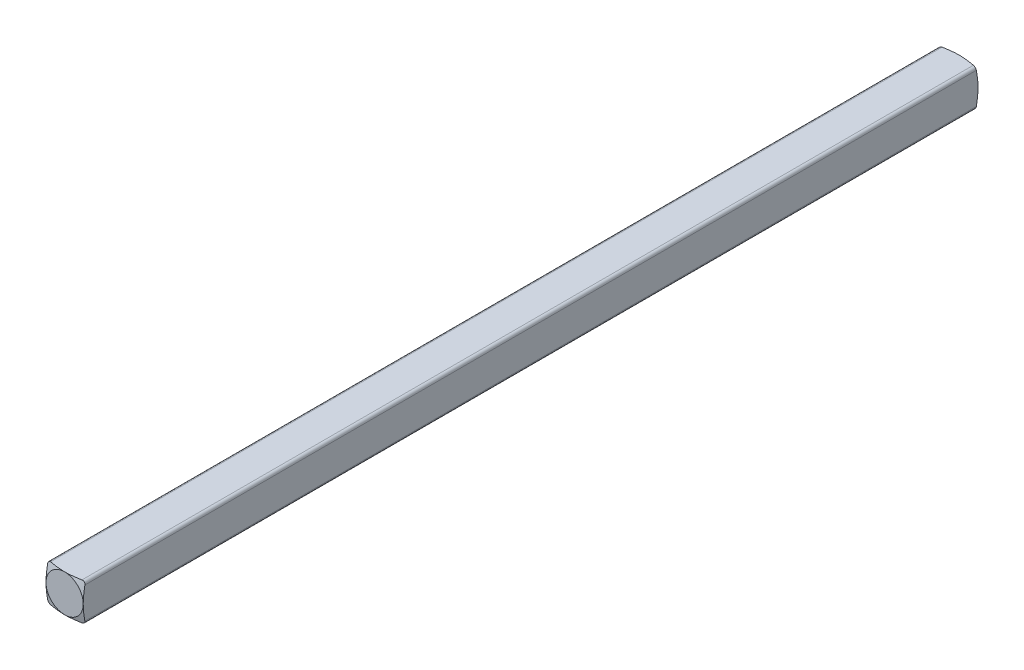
ISO-10303-21;
HEADER;
FILE_DESCRIPTION(('STEP AP214'),'2;1');
FILE_NAME('part.step','',(''),(''),'','','');
FILE_SCHEMA(('AUTOMOTIVE_DESIGN { 1 0 10303 214 1 1 1 1 }'));
ENDSEC;
DATA;
#1=APPLICATION_CONTEXT('core data for automotive mechanical design processes');
#2=APPLICATION_PROTOCOL_DEFINITION('international standard','automotive_design',2000,#1);
#3=PRODUCT_CONTEXT('',#1,'mechanical');
#4=PRODUCT('Part','Part','',(#3));
#5=PRODUCT_RELATED_PRODUCT_CATEGORY('part','',(#4));
#6=PRODUCT_DEFINITION_FORMATION('','',#4);
#7=PRODUCT_DEFINITION_CONTEXT('part definition',#1,'design');
#8=PRODUCT_DEFINITION('design','',#6,#7);
#9=PRODUCT_DEFINITION_SHAPE('','',#8);
#10=(LENGTH_UNIT() NAMED_UNIT(*) SI_UNIT(.MILLI.,.METRE.));
#11=(NAMED_UNIT(*) PLANE_ANGLE_UNIT() SI_UNIT($,.RADIAN.));
#12=(NAMED_UNIT(*) SI_UNIT($,.STERADIAN.) SOLID_ANGLE_UNIT());
#13=UNCERTAINTY_MEASURE_WITH_UNIT(LENGTH_MEASURE(1.E-05),#10,'distance_accuracy_value','');
#14=(GEOMETRIC_REPRESENTATION_CONTEXT(3) GLOBAL_UNCERTAINTY_ASSIGNED_CONTEXT((#13)) GLOBAL_UNIT_ASSIGNED_CONTEXT((#10,
#11,#12)) REPRESENTATION_CONTEXT('',''));
#15=CARTESIAN_POINT('',(0.,0.,0.));
#16=DIRECTION('',(0.,0.,1.));
#17=DIRECTION('',(1.,0.,0.));
#18=AXIS2_PLACEMENT_3D('',#15,#16,#17);
#19=CARTESIAN_POINT('',(-1.53487723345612,-1.585,38.1));
#20=DIRECTION('',(1.,0.,0.));
#21=DIRECTION('',(0.,1.,0.));
#22=AXIS2_PLACEMENT_3D('',#19,#20,#21);
#23=PLANE('',#22);
#24=CARTESIAN_POINT('',(-1.53487723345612,-3.16666521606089,-37.5259021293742));
#25=CARTESIAN_POINT('',(-1.53487723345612,-3.08469064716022,-37.5474134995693));
#26=CARTESIAN_POINT('',(-1.53487723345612,-3.00267602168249,-37.5687725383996));
#27=CARTESIAN_POINT('',(-1.53487723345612,-2.83854664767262,-37.6111088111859));
#28=CARTESIAN_POINT('',(-1.53487723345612,-2.75643189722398,-37.6320860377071));
#29=CARTESIAN_POINT('',(-1.53487723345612,-2.50995900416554,-37.6943162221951));
#30=CARTESIAN_POINT('',(-1.53487723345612,-2.3454255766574,-37.73488001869));
#31=CARTESIAN_POINT('',(-1.53487723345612,-2.01672815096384,-37.8129127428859));
#32=CARTESIAN_POINT('',(-1.53487723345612,-1.85256851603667,-37.850399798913));
#33=CARTESIAN_POINT('',(-1.53487723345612,-1.52315459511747,-37.9208840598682));
#34=CARTESIAN_POINT('',(-1.53487723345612,-1.3578996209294,-37.9538780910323));
#35=CARTESIAN_POINT('',(-1.53487723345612,-1.02346692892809,-38.0128592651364));
#36=CARTESIAN_POINT('',(-1.53487723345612,-0.854267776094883,-38.0387322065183));
#37=CARTESIAN_POINT('',(-1.53487723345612,-0.599515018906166,-38.068359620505));
#38=CARTESIAN_POINT('',(-1.53487723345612,-0.514501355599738,-38.0767023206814));
#39=CARTESIAN_POINT('',(-1.53487723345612,-0.344193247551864,-38.0897696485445));
#40=CARTESIAN_POINT('',(-1.53487723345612,-0.25889881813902,-38.0944944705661));
#41=CARTESIAN_POINT('',(-1.53487723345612,-0.0877661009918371,-38.0999590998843));
#42=CARTESIAN_POINT('',(-1.53487723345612,-0.00192717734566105,-38.1006795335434));
#43=CARTESIAN_POINT('',(-1.53487723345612,0.169686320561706,-38.09801863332));
#44=CARTESIAN_POINT('',(-1.53487723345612,0.255460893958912,-38.0946372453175));
#45=CARTESIAN_POINT('',(-1.53487723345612,0.426896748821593,-38.0840536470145));
#46=CARTESIAN_POINT('',(-1.53487723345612,0.512557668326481,-38.0768457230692));
#47=CARTESIAN_POINT('',(-1.53487723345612,0.683531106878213,-38.0591333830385));
#48=CARTESIAN_POINT('',(-1.53487723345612,0.76884362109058,-38.0486289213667));
#49=CARTESIAN_POINT('',(-1.53487723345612,0.974055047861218,-38.0200668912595));
#50=CARTESIAN_POINT('',(-1.53487723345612,1.09376665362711,-38.0006791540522));
#51=CARTESIAN_POINT('',(-1.53487723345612,1.33251777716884,-37.9580930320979));
#52=CARTESIAN_POINT('',(-1.53487723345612,1.45155714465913,-37.9348938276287));
#53=CARTESIAN_POINT('',(-1.53487723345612,1.68916216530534,-37.8858147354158));
#54=CARTESIAN_POINT('',(-1.53487723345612,1.80772743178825,-37.859932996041));
#55=CARTESIAN_POINT('',(-1.53487723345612,2.04441891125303,-37.8062944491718));
#56=CARTESIAN_POINT('',(-1.53487723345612,2.16254515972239,-37.7785377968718));
#57=CARTESIAN_POINT('',(-1.53487723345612,2.39875520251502,-37.721613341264));
#58=CARTESIAN_POINT('',(-1.53487723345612,2.51683821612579,-37.6924423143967));
#59=CARTESIAN_POINT('',(-1.53487723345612,2.75275603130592,-37.6331112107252));
#60=CARTESIAN_POINT('',(-1.53487723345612,2.87059082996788,-37.6029511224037));
#61=CARTESIAN_POINT('',(-1.53487723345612,3.22371274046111,-37.5114063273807));
#62=CARTESIAN_POINT('',(-1.53487723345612,3.45871696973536,-37.4489325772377));
#63=CARTESIAN_POINT('',(-1.53487723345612,3.92636425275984,-37.3228008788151));
#64=CARTESIAN_POINT('',(-1.53487723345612,4.15901102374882,-37.2591566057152));
#65=CARTESIAN_POINT('',(-1.53487723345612,4.62403801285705,-37.1307856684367));
#66=CARTESIAN_POINT('',(-1.53487723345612,4.85641819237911,-37.0660588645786));
#67=CARTESIAN_POINT('',(-1.53487723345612,5.31976447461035,-36.9362295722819));
#68=CARTESIAN_POINT('',(-1.53487723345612,5.55073162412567,-36.8711308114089));
#69=CARTESIAN_POINT('',(-1.53487723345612,6.01248807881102,-36.7404294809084));
#70=CARTESIAN_POINT('',(-1.53487723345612,6.24327740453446,-36.6748269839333));
#71=CARTESIAN_POINT('',(-1.53487723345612,6.47402102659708,-36.6090655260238));
#72=B_SPLINE_CURVE_WITH_KNOTS('',3,(#24,#25,#26,#27,#28,#29,#30,#31,#32,#33,#34,#35,#36,#37,#38,
#39,#40,#41,#42,#43,#44,#45,#46,#47,#48,#49,#50,#51,#52,#53,#54,#55,#56,#57,#58,#59,#60,#61,#62,
#63,#64,#65,#66,#67,#68,#69,#70,#71),.UNSPECIFIED.,.F.,.F.,(4,2,2,2,2,2,2,2,2,2,2,2,2,2,2,2,2,2,
2,2,2,2,2,4),(0.,0.254249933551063,0.508504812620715,1.01686983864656,1.52198475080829,
2.02745463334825,2.54061232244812,2.79681427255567,3.05300245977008,3.31042903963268,
3.56785901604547,3.82567446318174,4.08349347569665,4.4472125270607,4.81100990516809,
5.17506008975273,5.53908017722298,5.90397296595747,6.26887000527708,6.99835638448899,
7.72193914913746,8.44561600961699,9.1655133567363,9.88530875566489),.UNSPECIFIED.);
#73=CARTESIAN_POINT('',(-1.53487723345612,0.,-38.1));
#74=VERTEX_POINT('',#73);
#75=CARTESIAN_POINT('',(-1.53487723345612,-1.335,-37.95698643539));
#76=VERTEX_POINT('',#75);
#77=EDGE_CURVE('E126',#74,#76,#72,.F.);
#78=ORIENTED_EDGE('',*,*,#77,.T.);
#79=DIRECTION('',(0.,0.,-1.));
#80=VECTOR('',#79,1.);
#81=CARTESIAN_POINT('',(-1.53487723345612,-1.335,38.1));
#82=LINE('',#81,#80);
#83=CARTESIAN_POINT('',(-1.53487723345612,-1.335,37.95698643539));
#84=VERTEX_POINT('',#83);
#85=EDGE_CURVE('E56',#76,#84,#82,.F.);
#86=ORIENTED_EDGE('',*,*,#85,.T.);
#87=CARTESIAN_POINT('',(-1.53487723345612,-3.16666521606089,37.5259021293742));
#88=CARTESIAN_POINT('',(-1.53487723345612,-3.08469064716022,37.5474134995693));
#89=CARTESIAN_POINT('',(-1.53487723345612,-3.00267602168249,37.5687725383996));
#90=CARTESIAN_POINT('',(-1.53487723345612,-2.83854664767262,37.6111088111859));
#91=CARTESIAN_POINT('',(-1.53487723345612,-2.75643189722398,37.6320860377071));
#92=CARTESIAN_POINT('',(-1.53487723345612,-2.50995900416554,37.6943162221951));
#93=CARTESIAN_POINT('',(-1.53487723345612,-2.3454255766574,37.73488001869));
#94=CARTESIAN_POINT('',(-1.53487723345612,-2.01672815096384,37.8129127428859));
#95=CARTESIAN_POINT('',(-1.53487723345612,-1.85256851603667,37.850399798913));
#96=CARTESIAN_POINT('',(-1.53487723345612,-1.52315459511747,37.9208840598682));
#97=CARTESIAN_POINT('',(-1.53487723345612,-1.3578996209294,37.9538780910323));
#98=CARTESIAN_POINT('',(-1.53487723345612,-1.02346692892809,38.0128592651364));
#99=CARTESIAN_POINT('',(-1.53487723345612,-0.854267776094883,38.0387322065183));
#100=CARTESIAN_POINT('',(-1.53487723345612,-0.599515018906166,38.068359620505));
#101=CARTESIAN_POINT('',(-1.53487723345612,-0.514501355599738,38.0767023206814));
#102=CARTESIAN_POINT('',(-1.53487723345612,-0.344193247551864,38.0897696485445));
#103=CARTESIAN_POINT('',(-1.53487723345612,-0.25889881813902,38.0944944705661));
#104=CARTESIAN_POINT('',(-1.53487723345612,-0.0877661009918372,38.0999590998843));
#105=CARTESIAN_POINT('',(-1.53487723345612,-0.00192717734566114,38.1006795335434));
#106=CARTESIAN_POINT('',(-1.53487723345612,0.169686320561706,38.09801863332));
#107=CARTESIAN_POINT('',(-1.53487723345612,0.255460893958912,38.0946372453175));
#108=CARTESIAN_POINT('',(-1.53487723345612,0.426896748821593,38.0840536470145));
#109=CARTESIAN_POINT('',(-1.53487723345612,0.512557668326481,38.0768457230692));
#110=CARTESIAN_POINT('',(-1.53487723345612,0.683531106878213,38.0591333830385));
#111=CARTESIAN_POINT('',(-1.53487723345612,0.76884362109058,38.0486289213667));
#112=CARTESIAN_POINT('',(-1.53487723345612,0.974055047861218,38.0200668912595));
#113=CARTESIAN_POINT('',(-1.53487723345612,1.09376665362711,38.0006791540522));
#114=CARTESIAN_POINT('',(-1.53487723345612,1.33251777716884,37.9580930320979));
#115=CARTESIAN_POINT('',(-1.53487723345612,1.45155714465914,37.9348938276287));
#116=CARTESIAN_POINT('',(-1.53487723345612,1.68916216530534,37.8858147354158));
#117=CARTESIAN_POINT('',(-1.53487723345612,1.80772743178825,37.859932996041));
#118=CARTESIAN_POINT('',(-1.53487723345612,2.04441891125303,37.8062944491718));
#119=CARTESIAN_POINT('',(-1.53487723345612,2.16254515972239,37.7785377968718));
#120=CARTESIAN_POINT('',(-1.53487723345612,2.39875520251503,37.721613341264));
#121=CARTESIAN_POINT('',(-1.53487723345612,2.51683821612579,37.6924423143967));
#122=CARTESIAN_POINT('',(-1.53487723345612,2.75275603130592,37.6331112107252));
#123=CARTESIAN_POINT('',(-1.53487723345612,2.87059082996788,37.6029511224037));
#124=CARTESIAN_POINT('',(-1.53487723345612,3.22371274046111,37.5114063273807));
#125=CARTESIAN_POINT('',(-1.53487723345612,3.45871696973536,37.4489325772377));
#126=CARTESIAN_POINT('',(-1.53487723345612,3.92636425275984,37.3228008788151));
#127=CARTESIAN_POINT('',(-1.53487723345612,4.15901102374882,37.2591566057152));
#128=CARTESIAN_POINT('',(-1.53487723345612,4.62403801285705,37.1307856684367));
#129=CARTESIAN_POINT('',(-1.53487723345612,4.85641819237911,37.0660588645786));
#130=CARTESIAN_POINT('',(-1.53487723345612,5.31976447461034,36.9362295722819));
#131=CARTESIAN_POINT('',(-1.53487723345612,5.55073162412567,36.8711308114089));
#132=CARTESIAN_POINT('',(-1.53487723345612,6.01248807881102,36.7404294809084));
#133=CARTESIAN_POINT('',(-1.53487723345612,6.24327740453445,36.6748269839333));
#134=CARTESIAN_POINT('',(-1.53487723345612,6.47402102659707,36.6090655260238));
#135=B_SPLINE_CURVE_WITH_KNOTS('',3,(#87,#88,#89,#90,#91,#92,#93,#94,#95,#96,#97,#98,#99,#100,
#101,#102,#103,#104,#105,#106,#107,#108,#109,#110,#111,#112,#113,#114,#115,#116,#117,#118,#119,
#120,#121,#122,#123,#124,#125,#126,#127,#128,#129,#130,#131,#132,#133,#134),.UNSPECIFIED.,.F.,
.F.,(4,2,2,2,2,2,2,2,2,2,2,2,2,2,2,2,2,2,2,2,2,2,2,4),(0.,0.254249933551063,0.508504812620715,
1.01686983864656,1.52198475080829,2.02745463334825,2.54061232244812,2.79681427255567,
3.05300245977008,3.31042903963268,3.56785901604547,3.82567446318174,4.08349347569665,
4.44721252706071,4.81100990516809,5.17506008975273,5.53908017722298,5.90397296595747,
6.26887000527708,6.99835638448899,7.72193914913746,8.44561600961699,9.16551335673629,
9.88530875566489),.UNSPECIFIED.);
#136=CARTESIAN_POINT('',(-1.53487723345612,0.,38.1));
#137=VERTEX_POINT('',#136);
#138=EDGE_CURVE('E453',#84,#137,#135,.T.);
#139=ORIENTED_EDGE('',*,*,#138,.T.);
#140=CARTESIAN_POINT('',(-1.53487723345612,1.33500000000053,37.9569864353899));
#141=VERTEX_POINT('',#140);
#142=EDGE_CURVE('E187',#137,#141,#135,.T.);
#143=ORIENTED_EDGE('',*,*,#142,.T.);
#144=DIRECTION('',(0.,0.,-1.));
#145=VECTOR('',#144,1.);
#146=CARTESIAN_POINT('',(-1.53487723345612,1.335,38.1));
#147=LINE('',#146,#145);
#148=CARTESIAN_POINT('',(-1.53487723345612,1.33500000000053,-37.9569864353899));
#149=VERTEX_POINT('',#148);
#150=EDGE_CURVE('E128',#141,#149,#147,.T.);
#151=ORIENTED_EDGE('',*,*,#150,.T.);
#152=EDGE_CURVE('E124',#149,#74,#72,.F.);
#153=ORIENTED_EDGE('',*,*,#152,.T.);
#154=EDGE_LOOP('',(#78,#86,#139,#143,#151,#153));
#155=FACE_BOUND('',#154,.T.);
#156=ADVANCED_FACE('F30',(#155),#23,.F.);
#157=CARTESIAN_POINT('',(-1.53487723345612,-1.585,38.1));
#158=DIRECTION('',(0.,1.,0.));
#159=DIRECTION('',(-1.,0.,0.));
#160=AXIS2_PLACEMENT_3D('',#157,#158,#159);
#161=PLANE('',#160);
#162=CARTESIAN_POINT('',(-3.11654636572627,-1.585,-37.5259011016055));
#163=CARTESIAN_POINT('',(-3.03457163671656,-1.585,-37.5474125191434));
#164=CARTESIAN_POINT('',(-2.95255685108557,-1.585,-37.5687716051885));
#165=CARTESIAN_POINT('',(-2.78842715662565,-1.585,-37.6111079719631));
#166=CARTESIAN_POINT('',(-2.70631224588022,-1.585,-37.632085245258));
#167=CARTESIAN_POINT('',(-2.45983887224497,-1.585,-37.6943155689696));
#168=CARTESIAN_POINT('',(-2.2953051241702,-1.585,-37.7348794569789));
#169=CARTESIAN_POINT('',(-1.96660706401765,-1.585,-37.8129123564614));
#170=CARTESIAN_POINT('',(-1.80244711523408,-1.585,-37.8503994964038));
#171=CARTESIAN_POINT('',(-1.4730325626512,-1.585,-37.9208839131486));
#172=CARTESIAN_POINT('',(-1.30777727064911,-1.585,-37.9538780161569));
#173=CARTESIAN_POINT('',(-0.973343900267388,-1.585,-38.0128593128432));
#174=CARTESIAN_POINT('',(-0.804144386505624,-1.585,-38.0387323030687));
#175=CARTESIAN_POINT('',(-0.549391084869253,-1.585,-38.0683597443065));
#176=CARTESIAN_POINT('',(-0.464377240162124,-1.585,-38.0767024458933));
#177=CARTESIAN_POINT('',(-0.294068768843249,-1.585,-38.0897697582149));
#178=CARTESIAN_POINT('',(-0.20877415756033,-1.585,-38.0944945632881));
#179=CARTESIAN_POINT('',(-0.0376410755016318,-1.585,-38.0999591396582));
#180=CARTESIAN_POINT('',(0.0481980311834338,-1.585,-38.100679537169));
#181=CARTESIAN_POINT('',(0.219811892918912,-1.585,-38.0980185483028));
#182=CARTESIAN_POINT('',(0.305586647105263,-1.585,-38.0946371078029));
#183=CARTESIAN_POINT('',(0.477022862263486,-1.585,-38.084053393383));
#184=CARTESIAN_POINT('',(0.562683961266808,-1.585,-38.0768454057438));
#185=CARTESIAN_POINT('',(0.733657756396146,-1.585,-38.05913293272));
#186=CARTESIAN_POINT('',(0.818970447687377,-1.585,-38.0486284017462));
#187=CARTESIAN_POINT('',(1.02418204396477,-1.585,-38.0200662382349));
#188=CARTESIAN_POINT('',(1.14389364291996,-1.585,-38.0006784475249));
#189=CARTESIAN_POINT('',(1.38264475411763,-1.585,-37.9580922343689));
#190=CARTESIAN_POINT('',(1.50168411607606,-1.585,-37.9348929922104));
#191=CARTESIAN_POINT('',(1.73928912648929,-1.585,-37.8858138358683));
#192=CARTESIAN_POINT('',(1.85785438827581,-1.585,-37.8599320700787));
#193=CARTESIAN_POINT('',(2.09454585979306,-1.585,-37.8062934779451));
#194=CARTESIAN_POINT('',(2.21267210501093,-1.585,-37.7785368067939));
#195=CARTESIAN_POINT('',(2.44888213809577,-1.585,-37.7216123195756));
#196=CARTESIAN_POINT('',(2.56696514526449,-1.585,-37.6924412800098));
#197=CARTESIAN_POINT('',(2.80288294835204,-1.585,-37.6331101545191));
#198=CARTESIAN_POINT('',(2.9207177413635,-1.585,-37.602950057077));
#199=CARTESIAN_POINT('',(3.273839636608,-1.585,-37.5114052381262));
#200=CARTESIAN_POINT('',(3.50884385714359,-1.585,-37.4489314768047));
#201=CARTESIAN_POINT('',(3.9764911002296,-1.585,-37.3227997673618));
#202=CARTESIAN_POINT('',(4.20913784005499,-1.585,-37.2591554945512));
#203=CARTESIAN_POINT('',(4.67416476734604,-1.585,-37.1307845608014));
#204=CARTESIAN_POINT('',(4.90654491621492,-1.585,-37.0660577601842));
#205=CARTESIAN_POINT('',(5.36989115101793,-1.585,-36.9362284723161));
#206=CARTESIAN_POINT('',(5.6008582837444,-1.585,-36.8711297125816));
#207=CARTESIAN_POINT('',(6.06261470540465,-1.585,-36.7404283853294));
#208=CARTESIAN_POINT('',(6.29340401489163,-1.585,-36.6748258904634));
#209=CARTESIAN_POINT('',(6.5241476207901,-1.585,-36.6090644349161));
#210=B_SPLINE_CURVE_WITH_KNOTS('',3,(#162,#163,#164,#165,#166,#167,#168,#169,#170,#171,#172,
#173,#174,#175,#176,#177,#178,#179,#180,#181,#182,#183,#184,#185,#186,#187,#188,#189,#190,#191,
#192,#193,#194,#195,#196,#197,#198,#199,#200,#201,#202,#203,#204,#205,#206,#207,#208,#209),
.UNSPECIFIED.,.F.,.F.,(4,2,2,2,2,2,2,2,2,2,2,2,2,2,2,2,2,2,2,2,2,2,2,4),(0.,0.25425043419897,
0.508505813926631,1.01687183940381,1.52198772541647,2.02745858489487,2.54061736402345,
2.79681985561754,3.05300858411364,3.31043571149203,3.56786623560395,3.82568223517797,
4.08350180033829,4.44722085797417,4.81101824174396,5.17506842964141,5.53908852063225,
5.90398129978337,6.26887832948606,6.99836469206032,7.72194736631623,8.44562413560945,
9.16552143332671,9.88531678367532),.UNSPECIFIED.);
#211=CARTESIAN_POINT('',(0.0501227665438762,-1.585,-38.1));
#212=VERTEX_POINT('',#211);
#213=CARTESIAN_POINT('',(1.38512276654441,-1.585,-37.9569864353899));
#214=VERTEX_POINT('',#213);
#215=EDGE_CURVE('E208',#212,#214,#210,.T.);
#216=ORIENTED_EDGE('',*,*,#215,.T.);
#217=DIRECTION('',(0.,0.,-1.));
#218=VECTOR('',#217,1.);
#219=CARTESIAN_POINT('',(1.38512276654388,-1.585,38.1));
#220=LINE('',#219,#218);
#221=CARTESIAN_POINT('',(1.38512276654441,-1.585,37.9569864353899));
#222=VERTEX_POINT('',#221);
#223=EDGE_CURVE('E426',#214,#222,#220,.F.);
#224=ORIENTED_EDGE('',*,*,#223,.T.);
#225=CARTESIAN_POINT('',(-3.11654636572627,-1.585,37.5259011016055));
#226=CARTESIAN_POINT('',(-3.03457163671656,-1.585,37.5474125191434));
#227=CARTESIAN_POINT('',(-2.95255685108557,-1.585,37.5687716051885));
#228=CARTESIAN_POINT('',(-2.78842715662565,-1.585,37.6111079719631));
#229=CARTESIAN_POINT('',(-2.70631224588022,-1.585,37.632085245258));
#230=CARTESIAN_POINT('',(-2.45983887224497,-1.585,37.6943155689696));
#231=CARTESIAN_POINT('',(-2.2953051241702,-1.585,37.7348794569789));
#232=CARTESIAN_POINT('',(-1.96660706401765,-1.585,37.8129123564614));
#233=CARTESIAN_POINT('',(-1.80244711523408,-1.585,37.8503994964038));
#234=CARTESIAN_POINT('',(-1.4730325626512,-1.585,37.9208839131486));
#235=CARTESIAN_POINT('',(-1.30777727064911,-1.585,37.9538780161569));
#236=CARTESIAN_POINT('',(-0.973343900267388,-1.585,38.0128593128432));
#237=CARTESIAN_POINT('',(-0.804144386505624,-1.585,38.0387323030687));
#238=CARTESIAN_POINT('',(-0.549391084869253,-1.585,38.0683597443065));
#239=CARTESIAN_POINT('',(-0.464377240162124,-1.585,38.0767024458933));
#240=CARTESIAN_POINT('',(-0.294068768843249,-1.585,38.0897697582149));
#241=CARTESIAN_POINT('',(-0.20877415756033,-1.585,38.0944945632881));
#242=CARTESIAN_POINT('',(-0.037641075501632,-1.585,38.0999591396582));
#243=CARTESIAN_POINT('',(0.0481980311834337,-1.585,38.100679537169));
#244=CARTESIAN_POINT('',(0.219811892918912,-1.585,38.0980185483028));
#245=CARTESIAN_POINT('',(0.305586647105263,-1.585,38.0946371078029));
#246=CARTESIAN_POINT('',(0.477022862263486,-1.585,38.084053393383));
#247=CARTESIAN_POINT('',(0.562683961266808,-1.585,38.0768454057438));
#248=CARTESIAN_POINT('',(0.733657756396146,-1.585,38.05913293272));
#249=CARTESIAN_POINT('',(0.818970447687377,-1.585,38.0486284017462));
#250=CARTESIAN_POINT('',(1.02418204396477,-1.585,38.0200662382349));
#251=CARTESIAN_POINT('',(1.14389364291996,-1.585,38.0006784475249));
#252=CARTESIAN_POINT('',(1.38264475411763,-1.585,37.9580922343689));
#253=CARTESIAN_POINT('',(1.50168411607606,-1.585,37.9348929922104));
#254=CARTESIAN_POINT('',(1.73928912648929,-1.585,37.8858138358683));
#255=CARTESIAN_POINT('',(1.8578543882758,-1.585,37.8599320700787));
#256=CARTESIAN_POINT('',(2.09454585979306,-1.585,37.8062934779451));
#257=CARTESIAN_POINT('',(2.21267210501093,-1.585,37.7785368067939));
#258=CARTESIAN_POINT('',(2.44888213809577,-1.585,37.7216123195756));
#259=CARTESIAN_POINT('',(2.56696514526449,-1.585,37.6924412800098));
#260=CARTESIAN_POINT('',(2.80288294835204,-1.585,37.6331101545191));
#261=CARTESIAN_POINT('',(2.92071774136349,-1.585,37.602950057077));
#262=CARTESIAN_POINT('',(3.273839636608,-1.585,37.5114052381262));
#263=CARTESIAN_POINT('',(3.50884385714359,-1.585,37.4489314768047));
#264=CARTESIAN_POINT('',(3.9764911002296,-1.585,37.3227997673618));
#265=CARTESIAN_POINT('',(4.20913784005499,-1.585,37.2591554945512));
#266=CARTESIAN_POINT('',(4.67416476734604,-1.585,37.1307845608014));
#267=CARTESIAN_POINT('',(4.90654491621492,-1.585,37.0660577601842));
#268=CARTESIAN_POINT('',(5.36989115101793,-1.585,36.9362284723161));
#269=CARTESIAN_POINT('',(5.6008582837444,-1.585,36.8711297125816));
#270=CARTESIAN_POINT('',(6.06261470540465,-1.585,36.7404283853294));
#271=CARTESIAN_POINT('',(6.29340401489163,-1.585,36.6748258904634));
#272=CARTESIAN_POINT('',(6.5241476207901,-1.585,36.6090644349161));
#273=B_SPLINE_CURVE_WITH_KNOTS('',3,(#225,#226,#227,#228,#229,#230,#231,#232,#233,#234,#235,
#236,#237,#238,#239,#240,#241,#242,#243,#244,#245,#246,#247,#248,#249,#250,#251,#252,#253,#254,
#255,#256,#257,#258,#259,#260,#261,#262,#263,#264,#265,#266,#267,#268,#269,#270,#271,#272),
.UNSPECIFIED.,.F.,.F.,(4,2,2,2,2,2,2,2,2,2,2,2,2,2,2,2,2,2,2,2,2,2,2,4),(0.,0.25425043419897,
0.508505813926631,1.01687183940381,1.52198772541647,2.02745858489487,2.54061736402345,
2.79681985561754,3.05300858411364,3.31043571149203,3.56786623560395,3.82568223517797,
4.08350180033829,4.44722085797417,4.81101824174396,5.1750684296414,5.53908852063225,
5.90398129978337,6.26887832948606,6.99836469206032,7.72194736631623,8.44562413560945,
9.16552143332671,9.88531678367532),.UNSPECIFIED.);
#274=CARTESIAN_POINT('',(0.0501227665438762,-1.585,38.1));
#275=VERTEX_POINT('',#274);
#276=EDGE_CURVE('E174',#222,#275,#273,.F.);
#277=ORIENTED_EDGE('',*,*,#276,.T.);
#278=CARTESIAN_POINT('',(-1.28487723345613,-1.585,37.95698643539));
#279=VERTEX_POINT('',#278);
#280=EDGE_CURVE('E176',#275,#279,#273,.F.);
#281=ORIENTED_EDGE('',*,*,#280,.T.);
#282=DIRECTION('',(0.,0.,-1.));
#283=VECTOR('',#282,1.);
#284=CARTESIAN_POINT('',(-1.28487723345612,-1.585,38.1));
#285=LINE('',#284,#283);
#286=CARTESIAN_POINT('',(-1.28487723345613,-1.585,-37.95698643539));
#287=VERTEX_POINT('',#286);
#288=EDGE_CURVE('E431',#279,#287,#285,.T.);
#289=ORIENTED_EDGE('',*,*,#288,.T.);
#290=EDGE_CURVE('E141',#287,#212,#210,.T.);
#291=ORIENTED_EDGE('',*,*,#290,.T.);
#292=EDGE_LOOP('',(#216,#224,#277,#281,#289,#291));
#293=FACE_BOUND('',#292,.T.);
#294=ADVANCED_FACE('F197',(#293),#161,.F.);
#295=CARTESIAN_POINT('',(1.63512276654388,-1.585,38.1));
#296=DIRECTION('',(-1.,0.,0.));
#297=DIRECTION('',(0.,-1.,0.));
#298=AXIS2_PLACEMENT_3D('',#295,#296,#297);
#299=PLANE('',#298);
#300=CARTESIAN_POINT('',(1.63512276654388,-3.16666913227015,-37.5259011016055));
#301=CARTESIAN_POINT('',(1.63512276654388,-3.08469440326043,-37.5474125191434));
#302=CARTESIAN_POINT('',(1.63512276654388,-3.00267961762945,-37.5687716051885));
#303=CARTESIAN_POINT('',(1.63512276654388,-2.83854992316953,-37.6111079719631));
#304=CARTESIAN_POINT('',(1.63512276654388,-2.7564350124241,-37.632085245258));
#305=CARTESIAN_POINT('',(1.63512276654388,-2.50996163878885,-37.6943155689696));
#306=CARTESIAN_POINT('',(1.63512276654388,-2.34542789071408,-37.7348794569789));
#307=CARTESIAN_POINT('',(1.63512276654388,-2.01672983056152,-37.8129123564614));
#308=CARTESIAN_POINT('',(1.63512276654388,-1.85256988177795,-37.8503994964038));
#309=CARTESIAN_POINT('',(1.63512276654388,-1.52315532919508,-37.9208839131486));
#310=CARTESIAN_POINT('',(1.63512276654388,-1.35790003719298,-37.9538780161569));
#311=CARTESIAN_POINT('',(1.63512276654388,-1.02346666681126,-38.0128593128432));
#312=CARTESIAN_POINT('',(1.63512276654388,-0.854267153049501,-38.0387323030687));
#313=CARTESIAN_POINT('',(1.63512276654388,-0.599513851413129,-38.0683597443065));
#314=CARTESIAN_POINT('',(1.63512276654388,-0.514500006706,-38.0767024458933));
#315=CARTESIAN_POINT('',(1.63512276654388,-0.344191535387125,-38.0897697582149));
#316=CARTESIAN_POINT('',(1.63512276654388,-0.258896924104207,-38.0944945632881));
#317=CARTESIAN_POINT('',(1.63512276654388,-0.0877638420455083,-38.0999591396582));
#318=CARTESIAN_POINT('',(1.63512276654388,-0.00192473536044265,-38.100679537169));
#319=CARTESIAN_POINT('',(1.63512276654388,0.169689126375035,-38.0980185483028));
#320=CARTESIAN_POINT('',(1.63512276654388,0.255463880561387,-38.0946371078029));
#321=CARTESIAN_POINT('',(1.63512276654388,0.426900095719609,-38.084053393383));
#322=CARTESIAN_POINT('',(1.63512276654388,0.512561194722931,-38.0768454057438));
#323=CARTESIAN_POINT('',(1.63512276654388,0.683534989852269,-38.05913293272));
#324=CARTESIAN_POINT('',(1.63512276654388,0.7688476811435,-38.0486284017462));
#325=CARTESIAN_POINT('',(1.63512276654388,0.974059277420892,-38.0200662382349));
#326=CARTESIAN_POINT('',(1.63512276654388,1.09377087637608,-38.0006784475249));
#327=CARTESIAN_POINT('',(1.63512276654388,1.33252198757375,-37.9580922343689));
#328=CARTESIAN_POINT('',(1.63512276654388,1.45156134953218,-37.9348929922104));
#329=CARTESIAN_POINT('',(1.63512276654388,1.68916635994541,-37.8858138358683));
#330=CARTESIAN_POINT('',(1.63512276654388,1.80773162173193,-37.8599320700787));
#331=CARTESIAN_POINT('',(1.63512276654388,2.04442309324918,-37.8062934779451));
#332=CARTESIAN_POINT('',(1.63512276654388,2.16254933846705,-37.7785368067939));
#333=CARTESIAN_POINT('',(1.63512276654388,2.39875937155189,-37.7216123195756));
#334=CARTESIAN_POINT('',(1.63512276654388,2.51684237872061,-37.6924412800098));
#335=CARTESIAN_POINT('',(1.63512276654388,2.75276018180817,-37.6331101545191));
#336=CARTESIAN_POINT('',(1.63512276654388,2.87059497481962,-37.602950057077));
#337=CARTESIAN_POINT('',(1.63512276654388,3.22371687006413,-37.5114052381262));
#338=CARTESIAN_POINT('',(1.63512276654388,3.45872109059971,-37.4489314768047));
#339=CARTESIAN_POINT('',(1.63512276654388,3.92636833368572,-37.3227997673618));
#340=CARTESIAN_POINT('',(1.63512276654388,4.15901507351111,-37.2591554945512));
#341=CARTESIAN_POINT('',(1.63512276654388,4.62404200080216,-37.1307845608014));
#342=CARTESIAN_POINT('',(1.63512276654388,4.85642214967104,-37.0660577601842));
#343=CARTESIAN_POINT('',(1.63512276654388,5.31976838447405,-36.9362284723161));
#344=CARTESIAN_POINT('',(1.63512276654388,5.55073551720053,-36.8711297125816));
#345=CARTESIAN_POINT('',(1.63512276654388,6.01249193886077,-36.7404283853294));
#346=CARTESIAN_POINT('',(1.63512276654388,6.24328124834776,-36.6748258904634));
#347=CARTESIAN_POINT('',(1.63512276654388,6.47402485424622,-36.6090644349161));
#348=B_SPLINE_CURVE_WITH_KNOTS('',3,(#300,#301,#302,#303,#304,#305,#306,#307,#308,#309,#310,
#311,#312,#313,#314,#315,#316,#317,#318,#319,#320,#321,#322,#323,#324,#325,#326,#327,#328,#329,
#330,#331,#332,#333,#334,#335,#336,#337,#338,#339,#340,#341,#342,#343,#344,#345,#346,#347),
.UNSPECIFIED.,.F.,.F.,(4,2,2,2,2,2,2,2,2,2,2,2,2,2,2,2,2,2,2,2,2,2,2,4),(0.,0.254250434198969,
0.508505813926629,1.01687183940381,1.52198772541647,2.02745858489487,2.54061736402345,
2.79681985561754,3.05300858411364,3.31043571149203,3.56786623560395,3.82568223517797,
4.08350180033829,4.44722085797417,4.81101824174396,5.1750684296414,5.53908852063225,
5.90398129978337,6.26887832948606,6.99836469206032,7.72194736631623,8.44562413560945,
9.16552143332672,9.88531678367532),.UNSPECIFIED.);
#349=CARTESIAN_POINT('',(1.63512276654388,0.,-38.1));
#350=VERTEX_POINT('',#349);
#351=CARTESIAN_POINT('',(1.63512276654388,1.33500000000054,-37.9569864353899));
#352=VERTEX_POINT('',#351);
#353=EDGE_CURVE('E215',#350,#352,#348,.T.);
#354=ORIENTED_EDGE('',*,*,#353,.T.);
#355=DIRECTION('',(0.,0.,-1.));
#356=VECTOR('',#355,1.);
#357=CARTESIAN_POINT('',(1.63512276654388,1.335,38.1));
#358=LINE('',#357,#356);
#359=CARTESIAN_POINT('',(1.63512276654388,1.33500000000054,37.9569864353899));
#360=VERTEX_POINT('',#359);
#361=EDGE_CURVE('E437',#352,#360,#358,.F.);
#362=ORIENTED_EDGE('',*,*,#361,.T.);
#363=CARTESIAN_POINT('',(1.63512276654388,-3.16666913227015,37.5259011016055));
#364=CARTESIAN_POINT('',(1.63512276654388,-3.08469440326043,37.5474125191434));
#365=CARTESIAN_POINT('',(1.63512276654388,-3.00267961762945,37.5687716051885));
#366=CARTESIAN_POINT('',(1.63512276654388,-2.83854992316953,37.6111079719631));
#367=CARTESIAN_POINT('',(1.63512276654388,-2.7564350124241,37.632085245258));
#368=CARTESIAN_POINT('',(1.63512276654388,-2.50996163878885,37.6943155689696));
#369=CARTESIAN_POINT('',(1.63512276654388,-2.34542789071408,37.7348794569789));
#370=CARTESIAN_POINT('',(1.63512276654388,-2.01672983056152,37.8129123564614));
#371=CARTESIAN_POINT('',(1.63512276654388,-1.85256988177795,37.8503994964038));
#372=CARTESIAN_POINT('',(1.63512276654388,-1.52315532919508,37.9208839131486));
#373=CARTESIAN_POINT('',(1.63512276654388,-1.35790003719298,37.9538780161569));
#374=CARTESIAN_POINT('',(1.63512276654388,-1.02346666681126,38.0128593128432));
#375=CARTESIAN_POINT('',(1.63512276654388,-0.854267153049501,38.0387323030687));
#376=CARTESIAN_POINT('',(1.63512276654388,-0.599513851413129,38.0683597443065));
#377=CARTESIAN_POINT('',(1.63512276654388,-0.514500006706,38.0767024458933));
#378=CARTESIAN_POINT('',(1.63512276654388,-0.344191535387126,38.0897697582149));
#379=CARTESIAN_POINT('',(1.63512276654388,-0.258896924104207,38.0944945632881));
#380=CARTESIAN_POINT('',(1.63512276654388,-0.0877638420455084,38.0999591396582));
#381=CARTESIAN_POINT('',(1.63512276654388,-0.00192473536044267,38.100679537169));
#382=CARTESIAN_POINT('',(1.63512276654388,0.169689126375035,38.0980185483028));
#383=CARTESIAN_POINT('',(1.63512276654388,0.255463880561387,38.0946371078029));
#384=CARTESIAN_POINT('',(1.63512276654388,0.426900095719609,38.084053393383));
#385=CARTESIAN_POINT('',(1.63512276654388,0.512561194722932,38.0768454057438));
#386=CARTESIAN_POINT('',(1.63512276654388,0.683534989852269,38.05913293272));
#387=CARTESIAN_POINT('',(1.63512276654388,0.7688476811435,38.0486284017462));
#388=CARTESIAN_POINT('',(1.63512276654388,0.974059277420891,38.0200662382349));
#389=CARTESIAN_POINT('',(1.63512276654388,1.09377087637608,38.0006784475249));
#390=CARTESIAN_POINT('',(1.63512276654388,1.33252198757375,37.9580922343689));
#391=CARTESIAN_POINT('',(1.63512276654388,1.45156134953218,37.9348929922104));
#392=CARTESIAN_POINT('',(1.63512276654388,1.68916635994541,37.8858138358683));
#393=CARTESIAN_POINT('',(1.63512276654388,1.80773162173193,37.8599320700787));
#394=CARTESIAN_POINT('',(1.63512276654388,2.04442309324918,37.8062934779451));
#395=CARTESIAN_POINT('',(1.63512276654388,2.16254933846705,37.7785368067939));
#396=CARTESIAN_POINT('',(1.63512276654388,2.39875937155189,37.7216123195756));
#397=CARTESIAN_POINT('',(1.63512276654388,2.51684237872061,37.6924412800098));
#398=CARTESIAN_POINT('',(1.63512276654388,2.75276018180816,37.6331101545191));
#399=CARTESIAN_POINT('',(1.63512276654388,2.87059497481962,37.602950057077));
#400=CARTESIAN_POINT('',(1.63512276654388,3.22371687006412,37.5114052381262));
#401=CARTESIAN_POINT('',(1.63512276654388,3.45872109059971,37.4489314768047));
#402=CARTESIAN_POINT('',(1.63512276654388,3.92636833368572,37.3227997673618));
#403=CARTESIAN_POINT('',(1.63512276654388,4.15901507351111,37.2591554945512));
#404=CARTESIAN_POINT('',(1.63512276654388,4.62404200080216,37.1307845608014));
#405=CARTESIAN_POINT('',(1.63512276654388,4.85642214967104,37.0660577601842));
#406=CARTESIAN_POINT('',(1.63512276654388,5.31976838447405,36.9362284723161));
#407=CARTESIAN_POINT('',(1.63512276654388,5.55073551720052,36.8711297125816));
#408=CARTESIAN_POINT('',(1.63512276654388,6.01249193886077,36.7404283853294));
#409=CARTESIAN_POINT('',(1.63512276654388,6.24328124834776,36.6748258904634));
#410=CARTESIAN_POINT('',(1.63512276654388,6.47402485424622,36.6090644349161));
#411=B_SPLINE_CURVE_WITH_KNOTS('',3,(#363,#364,#365,#366,#367,#368,#369,#370,#371,#372,#373,
#374,#375,#376,#377,#378,#379,#380,#381,#382,#383,#384,#385,#386,#387,#388,#389,#390,#391,#392,
#393,#394,#395,#396,#397,#398,#399,#400,#401,#402,#403,#404,#405,#406,#407,#408,#409,#410),
.UNSPECIFIED.,.F.,.F.,(4,2,2,2,2,2,2,2,2,2,2,2,2,2,2,2,2,2,2,2,2,2,2,4),(0.,0.254250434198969,
0.508505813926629,1.01687183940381,1.52198772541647,2.02745858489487,2.54061736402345,
2.79681985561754,3.05300858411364,3.31043571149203,3.56786623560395,3.82568223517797,
4.08350180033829,4.44722085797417,4.81101824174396,5.1750684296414,5.53908852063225,
5.90398129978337,6.26887832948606,6.99836469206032,7.72194736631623,8.44562413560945,
9.16552143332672,9.88531678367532),.UNSPECIFIED.);
#412=CARTESIAN_POINT('',(1.63512276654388,0.,38.1));
#413=VERTEX_POINT('',#412);
#414=EDGE_CURVE('E451',#360,#413,#411,.F.);
#415=ORIENTED_EDGE('',*,*,#414,.T.);
#416=CARTESIAN_POINT('',(1.63512276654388,-1.335,37.95698643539));
#417=VERTEX_POINT('',#416);
#418=EDGE_CURVE('E181',#413,#417,#411,.F.);
#419=ORIENTED_EDGE('',*,*,#418,.T.);
#420=DIRECTION('',(0.,0.,-1.));
#421=VECTOR('',#420,1.);
#422=CARTESIAN_POINT('',(1.63512276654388,-1.335,38.1));
#423=LINE('',#422,#421);
#424=CARTESIAN_POINT('',(1.63512276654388,-1.335,-37.95698643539));
#425=VERTEX_POINT('',#424);
#426=EDGE_CURVE('E428',#417,#425,#423,.T.);
#427=ORIENTED_EDGE('',*,*,#426,.T.);
#428=EDGE_CURVE('E214',#425,#350,#348,.T.);
#429=ORIENTED_EDGE('',*,*,#428,.T.);
#430=EDGE_LOOP('',(#354,#362,#415,#419,#427,#429));
#431=FACE_BOUND('',#430,.T.);
#432=ADVANCED_FACE('F201',(#431),#299,.F.);
#433=CARTESIAN_POINT('',(-1.53487723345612,1.585,38.1));
#434=DIRECTION('',(0.,-1.,0.));
#435=DIRECTION('',(1.,0.,0.));
#436=AXIS2_PLACEMENT_3D('',#433,#434,#435);
#437=PLANE('',#436);
#438=CARTESIAN_POINT('',(-3.11654244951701,1.585,37.5259021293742));
#439=CARTESIAN_POINT('',(-3.03456788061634,1.585,37.5474134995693));
#440=CARTESIAN_POINT('',(-2.95255325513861,1.585,37.5687725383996));
#441=CARTESIAN_POINT('',(-2.78842388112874,1.585,37.6111088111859));
#442=CARTESIAN_POINT('',(-2.7063091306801,1.585,37.6320860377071));
#443=CARTESIAN_POINT('',(-2.45983623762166,1.585,37.6943162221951));
#444=CARTESIAN_POINT('',(-2.29530281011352,1.585,37.73488001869));
#445=CARTESIAN_POINT('',(-1.96660538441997,1.585,37.8129127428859));
#446=CARTESIAN_POINT('',(-1.80244574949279,1.585,37.850399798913));
#447=CARTESIAN_POINT('',(-1.47303182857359,1.585,37.9208840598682));
#448=CARTESIAN_POINT('',(-1.30777685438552,1.585,37.9538780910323));
#449=CARTESIAN_POINT('',(-0.973344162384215,1.585,38.0128592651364));
#450=CARTESIAN_POINT('',(-0.804145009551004,1.585,38.0387322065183));
#451=CARTESIAN_POINT('',(-0.549392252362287,1.585,38.068359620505));
#452=CARTESIAN_POINT('',(-0.464378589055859,1.585,38.0767023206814));
#453=CARTESIAN_POINT('',(-0.294070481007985,1.585,38.0897696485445));
#454=CARTESIAN_POINT('',(-0.208776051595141,1.585,38.0944944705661));
#455=CARTESIAN_POINT('',(-0.037643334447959,1.585,38.0999590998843));
#456=CARTESIAN_POINT('',(0.0481955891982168,1.585,38.1006795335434));
#457=CARTESIAN_POINT('',(0.219809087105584,1.585,38.09801863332));
#458=CARTESIAN_POINT('',(0.30558366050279,1.585,38.0946372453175));
#459=CARTESIAN_POINT('',(0.477019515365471,1.585,38.0840536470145));
#460=CARTESIAN_POINT('',(0.562680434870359,1.585,38.0768457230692));
#461=CARTESIAN_POINT('',(0.733653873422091,1.585,38.0591333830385));
#462=CARTESIAN_POINT('',(0.818966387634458,1.585,38.0486289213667));
#463=CARTESIAN_POINT('',(1.0241778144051,1.585,38.0200668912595));
#464=CARTESIAN_POINT('',(1.14388942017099,1.585,38.0006791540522));
#465=CARTESIAN_POINT('',(1.38264054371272,1.585,37.9580930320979));
#466=CARTESIAN_POINT('',(1.50167991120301,1.585,37.9348938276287));
#467=CARTESIAN_POINT('',(1.73928493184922,1.585,37.8858147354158));
#468=CARTESIAN_POINT('',(1.85785019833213,1.585,37.859932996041));
#469=CARTESIAN_POINT('',(2.09454167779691,1.585,37.8062944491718));
#470=CARTESIAN_POINT('',(2.21266792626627,1.585,37.7785377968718));
#471=CARTESIAN_POINT('',(2.4488779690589,1.585,37.721613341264));
#472=CARTESIAN_POINT('',(2.56696098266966,1.585,37.6924423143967));
#473=CARTESIAN_POINT('',(2.8028787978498,1.585,37.6331112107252));
#474=CARTESIAN_POINT('',(2.92071359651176,1.585,37.6029511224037));
#475=CARTESIAN_POINT('',(3.27383550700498,1.585,37.5114063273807));
#476=CARTESIAN_POINT('',(3.50883973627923,1.585,37.4489325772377));
#477=CARTESIAN_POINT('',(3.97648701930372,1.585,37.3228008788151));
#478=CARTESIAN_POINT('',(4.20913379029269,1.585,37.2591566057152));
#479=CARTESIAN_POINT('',(4.67416077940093,1.585,37.1307856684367));
#480=CARTESIAN_POINT('',(4.90654095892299,1.585,37.0660588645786));
#481=CARTESIAN_POINT('',(5.36988724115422,1.585,36.9362295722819));
#482=CARTESIAN_POINT('',(5.60085439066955,1.585,36.8711308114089));
#483=CARTESIAN_POINT('',(6.0626108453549,1.585,36.7404294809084));
#484=CARTESIAN_POINT('',(6.29340017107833,1.585,36.6748269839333));
#485=CARTESIAN_POINT('',(6.52414379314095,1.585,36.6090655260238));
#486=B_SPLINE_CURVE_WITH_KNOTS('',3,(#438,#439,#440,#441,#442,#443,#444,#445,#446,#447,#448,
#449,#450,#451,#452,#453,#454,#455,#456,#457,#458,#459,#460,#461,#462,#463,#464,#465,#466,#467,
#468,#469,#470,#471,#472,#473,#474,#475,#476,#477,#478,#479,#480,#481,#482,#483,#484,#485),
.UNSPECIFIED.,.F.,.F.,(4,2,2,2,2,2,2,2,2,2,2,2,2,2,2,2,2,2,2,2,2,2,2,4),(0.,0.254249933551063,
0.508504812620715,1.01686983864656,1.5219847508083,2.02745463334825,2.54061232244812,
2.79681427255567,3.05300245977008,3.31042903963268,3.56785901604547,3.82567446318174,
4.08349347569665,4.4472125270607,4.81100990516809,5.17506008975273,5.53908017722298,
5.90397296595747,6.26887000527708,6.99835638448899,7.72193914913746,8.44561600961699,
9.16551335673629,9.88530875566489),.UNSPECIFIED.);
#487=CARTESIAN_POINT('',(0.0501227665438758,1.585,38.1));
#488=VERTEX_POINT('',#487);
#489=CARTESIAN_POINT('',(1.38512276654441,1.585,37.9569864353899));
#490=VERTEX_POINT('',#489);
#491=EDGE_CURVE('E449',#488,#490,#486,.T.);
#492=ORIENTED_EDGE('',*,*,#491,.T.);
#493=DIRECTION('',(0.,0.,-1.));
#494=VECTOR('',#493,1.);
#495=CARTESIAN_POINT('',(1.38512276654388,1.585,38.1));
#496=LINE('',#495,#494);
#497=CARTESIAN_POINT('',(1.38512276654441,1.585,-37.9569864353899));
#498=VERTEX_POINT('',#497);
#499=EDGE_CURVE('E157',#490,#498,#496,.T.);
#500=ORIENTED_EDGE('',*,*,#499,.T.);
#501=CARTESIAN_POINT('',(-3.11654244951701,1.585,-37.5259021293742));
#502=CARTESIAN_POINT('',(-3.03456788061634,1.585,-37.5474134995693));
#503=CARTESIAN_POINT('',(-2.95255325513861,1.585,-37.5687725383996));
#504=CARTESIAN_POINT('',(-2.78842388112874,1.585,-37.6111088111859));
#505=CARTESIAN_POINT('',(-2.7063091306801,1.585,-37.6320860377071));
#506=CARTESIAN_POINT('',(-2.45983623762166,1.585,-37.6943162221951));
#507=CARTESIAN_POINT('',(-2.29530281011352,1.585,-37.73488001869));
#508=CARTESIAN_POINT('',(-1.96660538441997,1.585,-37.8129127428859));
#509=CARTESIAN_POINT('',(-1.80244574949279,1.585,-37.850399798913));
#510=CARTESIAN_POINT('',(-1.47303182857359,1.585,-37.9208840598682));
#511=CARTESIAN_POINT('',(-1.30777685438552,1.585,-37.9538780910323));
#512=CARTESIAN_POINT('',(-0.973344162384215,1.585,-38.0128592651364));
#513=CARTESIAN_POINT('',(-0.804145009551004,1.585,-38.0387322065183));
#514=CARTESIAN_POINT('',(-0.549392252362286,1.585,-38.068359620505));
#515=CARTESIAN_POINT('',(-0.464378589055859,1.585,-38.0767023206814));
#516=CARTESIAN_POINT('',(-0.294070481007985,1.585,-38.0897696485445));
#517=CARTESIAN_POINT('',(-0.208776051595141,1.585,-38.0944944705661));
#518=CARTESIAN_POINT('',(-0.0376433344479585,1.585,-38.0999590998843));
#519=CARTESIAN_POINT('',(0.0481955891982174,1.585,-38.1006795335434));
#520=CARTESIAN_POINT('',(0.219809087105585,1.585,-38.09801863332));
#521=CARTESIAN_POINT('',(0.30558366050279,1.585,-38.0946372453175));
#522=CARTESIAN_POINT('',(0.477019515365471,1.585,-38.0840536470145));
#523=CARTESIAN_POINT('',(0.562680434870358,1.585,-38.0768457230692));
#524=CARTESIAN_POINT('',(0.733653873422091,1.585,-38.0591333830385));
#525=CARTESIAN_POINT('',(0.818966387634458,1.585,-38.0486289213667));
#526=CARTESIAN_POINT('',(1.0241778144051,1.585,-38.0200668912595));
#527=CARTESIAN_POINT('',(1.14388942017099,1.585,-38.0006791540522));
#528=CARTESIAN_POINT('',(1.38264054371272,1.585,-37.9580930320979));
#529=CARTESIAN_POINT('',(1.50167991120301,1.585,-37.9348938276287));
#530=CARTESIAN_POINT('',(1.73928493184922,1.585,-37.8858147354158));
#531=CARTESIAN_POINT('',(1.85785019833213,1.585,-37.859932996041));
#532=CARTESIAN_POINT('',(2.09454167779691,1.585,-37.8062944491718));
#533=CARTESIAN_POINT('',(2.21266792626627,1.585,-37.7785377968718));
#534=CARTESIAN_POINT('',(2.4488779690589,1.585,-37.721613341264));
#535=CARTESIAN_POINT('',(2.56696098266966,1.585,-37.6924423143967));
#536=CARTESIAN_POINT('',(2.8028787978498,1.585,-37.6331112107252));
#537=CARTESIAN_POINT('',(2.92071359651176,1.585,-37.6029511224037));
#538=CARTESIAN_POINT('',(3.27383550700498,1.585,-37.5114063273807));
#539=CARTESIAN_POINT('',(3.50883973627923,1.585,-37.4489325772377));
#540=CARTESIAN_POINT('',(3.97648701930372,1.585,-37.3228008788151));
#541=CARTESIAN_POINT('',(4.20913379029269,1.585,-37.2591566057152));
#542=CARTESIAN_POINT('',(4.67416077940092,1.585,-37.1307856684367));
#543=CARTESIAN_POINT('',(4.90654095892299,1.585,-37.0660588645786));
#544=CARTESIAN_POINT('',(5.36988724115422,1.585,-36.9362295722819));
#545=CARTESIAN_POINT('',(5.60085439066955,1.585,-36.8711308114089));
#546=CARTESIAN_POINT('',(6.0626108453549,1.585,-36.7404294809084));
#547=CARTESIAN_POINT('',(6.29340017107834,1.585,-36.6748269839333));
#548=CARTESIAN_POINT('',(6.52414379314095,1.585,-36.6090655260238));
#549=B_SPLINE_CURVE_WITH_KNOTS('',3,(#501,#502,#503,#504,#505,#506,#507,#508,#509,#510,#511,
#512,#513,#514,#515,#516,#517,#518,#519,#520,#521,#522,#523,#524,#525,#526,#527,#528,#529,#530,
#531,#532,#533,#534,#535,#536,#537,#538,#539,#540,#541,#542,#543,#544,#545,#546,#547,#548),
.UNSPECIFIED.,.F.,.F.,(4,2,2,2,2,2,2,2,2,2,2,2,2,2,2,2,2,2,2,2,2,2,2,4),(0.,0.254249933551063,
0.508504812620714,1.01686983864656,1.52198475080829,2.02745463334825,2.54061232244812,
2.79681427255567,3.05300245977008,3.31042903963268,3.56785901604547,3.82567446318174,
4.08349347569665,4.44721252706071,4.81100990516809,5.17506008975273,5.53908017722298,
5.90397296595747,6.26887000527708,6.99835638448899,7.72193914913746,8.44561600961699,
9.1655133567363,9.88530875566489),.UNSPECIFIED.);
#550=CARTESIAN_POINT('',(0.0501227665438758,1.585,-38.1));
#551=VERTEX_POINT('',#550);
#552=EDGE_CURVE('E286',#498,#551,#549,.F.);
#553=ORIENTED_EDGE('',*,*,#552,.T.);
#554=CARTESIAN_POINT('',(-1.28487723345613,1.585,-37.95698643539));
#555=VERTEX_POINT('',#554);
#556=EDGE_CURVE('E147',#551,#555,#549,.F.);
#557=ORIENTED_EDGE('',*,*,#556,.T.);
#558=DIRECTION('',(0.,0.,-1.));
#559=VECTOR('',#558,1.);
#560=CARTESIAN_POINT('',(-1.28487723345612,1.585,38.1));
#561=LINE('',#560,#559);
#562=CARTESIAN_POINT('',(-1.28487723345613,1.585,37.95698643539));
#563=VERTEX_POINT('',#562);
#564=EDGE_CURVE('E154',#555,#563,#561,.F.);
#565=ORIENTED_EDGE('',*,*,#564,.T.);
#566=EDGE_CURVE('E452',#563,#488,#486,.T.);
#567=ORIENTED_EDGE('',*,*,#566,.T.);
#568=EDGE_LOOP('',(#492,#500,#553,#557,#565,#567));
#569=FACE_BOUND('',#568,.T.);
#570=ADVANCED_FACE('F284',(#569),#437,.F.);
#571=CARTESIAN_POINT('',(0.050122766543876,0.,38.1));
#572=DIRECTION('',(0.,0.,-1.));
#573=DIRECTION('',(-1.,0.,0.));
#574=AXIS2_PLACEMENT_3D('',#571,#572,#573);
#575=CONICAL_SURFACE('',#574,1.585,1.28533346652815);
#576=ORIENTED_EDGE('',*,*,#566,.F.);
#577=CARTESIAN_POINT('',(-1.28487723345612,1.585,37.956986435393));
#578=CARTESIAN_POINT('',(-1.29858057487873,1.58501280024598,37.9543935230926));
#579=CARTESIAN_POINT('',(-1.31232953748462,1.58387377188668,37.9520258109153));
#580=CARTESIAN_POINT('',(-1.33952975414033,1.57933895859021,37.9477897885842));
#581=CARTESIAN_POINT('',(-1.35298098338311,1.57594298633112,37.9459215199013));
#582=CARTESIAN_POINT('',(-1.37920987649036,1.56693587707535,37.9427319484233));
#583=CARTESIAN_POINT('',(-1.39198672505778,1.56132212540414,37.9414112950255));
#584=CARTESIAN_POINT('',(-1.41645856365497,1.54802590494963,37.9393545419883));
#585=CARTESIAN_POINT('',(-1.42815409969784,1.54034448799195,37.9386181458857));
#586=CARTESIAN_POINT('',(-1.44992804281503,1.52327220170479,37.9377559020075));
#587=CARTESIAN_POINT('',(-1.46003047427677,1.51391247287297,37.937619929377));
#588=CARTESIAN_POINT('',(-1.4785602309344,1.49366689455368,37.9379343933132));
#589=CARTESIAN_POINT('',(-1.48698740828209,1.48278091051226,37.938384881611));
#590=CARTESIAN_POINT('',(-1.501871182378,1.45989425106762,37.9398547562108));
#591=CARTESIAN_POINT('',(-1.50834263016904,1.44790292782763,37.9408696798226));
#592=CARTESIAN_POINT('',(-1.51924013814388,1.42307778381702,37.9434401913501));
#593=CARTESIAN_POINT('',(-1.52366637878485,1.41024403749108,37.9449957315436));
#594=CARTESIAN_POINT('',(-1.52964010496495,1.38698094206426,37.9482106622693));
#595=CARTESIAN_POINT('',(-1.53160645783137,1.37664298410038,37.9497721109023));
#596=CARTESIAN_POINT('',(-1.53422570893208,1.35586233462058,37.9531749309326));
#597=CARTESIAN_POINT('',(-1.53488044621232,1.34541981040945,37.9550159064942));
#598=CARTESIAN_POINT('',(-1.53487723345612,1.33499999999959,37.9569864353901));
#599=B_SPLINE_CURVE_WITH_KNOTS('',3,(#577,#578,#579,#580,#581,#582,#583,#584,#585,#586,#587,
#588,#589,#590,#591,#592,#593,#594,#595,#596,#597,#598),.UNSPECIFIED.,.F.,.F.,(4,2,2,2,2,2,2,2,
2,2,4),(0.,0.0417956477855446,0.0835947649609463,0.125443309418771,0.167270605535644,
0.208389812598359,0.249512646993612,0.290314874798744,0.33111350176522,0.362946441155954,
0.394734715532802),.UNSPECIFIED.);
#600=EDGE_CURVE('E11',#563,#141,#599,.T.);
#601=ORIENTED_EDGE('',*,*,#600,.T.);
#602=ORIENTED_EDGE('',*,*,#142,.F.);
#603=CARTESIAN_POINT('',(0.050122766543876,0.,38.1));
#604=DIRECTION('',(0.,0.,-1.));
#605=DIRECTION('',(-1.,0.,0.));
#606=AXIS2_PLACEMENT_3D('',#603,#604,#605);
#607=CIRCLE('',#606,1.585);
#608=EDGE_CURVE('E131',#137,#488,#607,.T.);
#609=ORIENTED_EDGE('',*,*,#608,.T.);
#610=EDGE_LOOP('',(#576,#601,#602,#609));
#611=FACE_BOUND('',#610,.T.);
#612=ADVANCED_FACE('F310',(#611),#575,.T.);
#613=ORIENTED_EDGE('',*,*,#414,.F.);
#614=CARTESIAN_POINT('',(1.63512276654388,1.335,37.9569864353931));
#615=CARTESIAN_POINT('',(1.63513556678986,1.34870334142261,37.9543935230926));
#616=CARTESIAN_POINT('',(1.63399653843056,1.3624523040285,37.9520258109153));
#617=CARTESIAN_POINT('',(1.62946172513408,1.38965252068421,37.9477897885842));
#618=CARTESIAN_POINT('',(1.626065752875,1.40310374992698,37.9459215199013));
#619=CARTESIAN_POINT('',(1.61705864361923,1.42933264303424,37.9427319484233));
#620=CARTESIAN_POINT('',(1.61144489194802,1.44210949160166,37.9414112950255));
#621=CARTESIAN_POINT('',(1.5981486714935,1.46658133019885,37.9393545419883));
#622=CARTESIAN_POINT('',(1.59046725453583,1.47827686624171,37.9386181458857));
#623=CARTESIAN_POINT('',(1.57339496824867,1.5000508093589,37.9377559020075));
#624=CARTESIAN_POINT('',(1.56403523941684,1.51015324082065,37.937619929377));
#625=CARTESIAN_POINT('',(1.54378966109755,1.52868299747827,37.9379343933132));
#626=CARTESIAN_POINT('',(1.53290367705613,1.53711017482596,37.938384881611));
#627=CARTESIAN_POINT('',(1.5100170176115,1.55199394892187,37.9398547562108));
#628=CARTESIAN_POINT('',(1.4980256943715,1.55846539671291,37.9408696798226));
#629=CARTESIAN_POINT('',(1.4732005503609,1.56936290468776,37.9434401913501));
#630=CARTESIAN_POINT('',(1.46036680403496,1.57378914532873,37.9449957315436));
#631=CARTESIAN_POINT('',(1.43710370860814,1.57976287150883,37.9482106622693));
#632=CARTESIAN_POINT('',(1.42676575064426,1.58172922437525,37.9497721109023));
#633=CARTESIAN_POINT('',(1.40598510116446,1.58434847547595,37.9531749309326));
#634=CARTESIAN_POINT('',(1.39554257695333,1.58500321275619,37.9550159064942));
#635=CARTESIAN_POINT('',(1.38512276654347,1.585,37.9569864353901));
#636=B_SPLINE_CURVE_WITH_KNOTS('',3,(#614,#615,#616,#617,#618,#619,#620,#621,#622,#623,#624,
#625,#626,#627,#628,#629,#630,#631,#632,#633,#634,#635),.UNSPECIFIED.,.F.,.F.,(4,2,2,2,2,2,2,2,
2,2,4),(0.,0.0417956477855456,0.0835947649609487,0.125443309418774,0.167270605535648,
0.208389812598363,0.249512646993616,0.290314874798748,0.331113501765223,0.362946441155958,
0.394734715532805),.UNSPECIFIED.);
#637=EDGE_CURVE('E434',#360,#490,#636,.T.);
#638=ORIENTED_EDGE('',*,*,#637,.T.);
#639=ORIENTED_EDGE('',*,*,#491,.F.);
#640=CARTESIAN_POINT('',(0.050122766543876,0.,38.1));
#641=DIRECTION('',(0.,0.,-1.));
#642=DIRECTION('',(-1.,0.,0.));
#643=AXIS2_PLACEMENT_3D('',#640,#641,#642);
#644=CIRCLE('',#643,1.585);
#645=EDGE_CURVE('E167',#413,#488,#644,.F.);
#646=ORIENTED_EDGE('',*,*,#645,.F.);
#647=EDGE_LOOP('',(#613,#638,#639,#646));
#648=FACE_BOUND('',#647,.T.);
#649=ADVANCED_FACE('F316',(#648),#575,.T.);
#650=ORIENTED_EDGE('',*,*,#276,.F.);
#651=CARTESIAN_POINT('',(1.38512276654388,-1.585,37.9569864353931));
#652=CARTESIAN_POINT('',(1.39882610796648,-1.58501280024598,37.9543935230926));
#653=CARTESIAN_POINT('',(1.41257507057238,-1.58387377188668,37.9520258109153));
#654=CARTESIAN_POINT('',(1.43977528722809,-1.57933895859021,37.9477897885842));
#655=CARTESIAN_POINT('',(1.45322651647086,-1.57594298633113,37.9459215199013));
#656=CARTESIAN_POINT('',(1.47945540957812,-1.56693587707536,37.9427319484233));
#657=CARTESIAN_POINT('',(1.49223225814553,-1.56132212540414,37.9414112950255));
#658=CARTESIAN_POINT('',(1.51670409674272,-1.54802590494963,37.9393545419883));
#659=CARTESIAN_POINT('',(1.52839963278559,-1.54034448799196,37.9386181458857));
#660=CARTESIAN_POINT('',(1.55017357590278,-1.52327220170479,37.9377559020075));
#661=CARTESIAN_POINT('',(1.56027600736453,-1.51391247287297,37.937619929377));
#662=CARTESIAN_POINT('',(1.57880576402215,-1.49366689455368,37.9379343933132));
#663=CARTESIAN_POINT('',(1.58723294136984,-1.48278091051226,37.938384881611));
#664=CARTESIAN_POINT('',(1.60211671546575,-1.45989425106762,37.9398547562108));
#665=CARTESIAN_POINT('',(1.60858816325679,-1.44790292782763,37.9408696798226));
#666=CARTESIAN_POINT('',(1.61948567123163,-1.42307778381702,37.9434401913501));
#667=CARTESIAN_POINT('',(1.6239119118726,-1.41024403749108,37.9449957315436));
#668=CARTESIAN_POINT('',(1.62988563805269,-1.38698094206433,37.9482106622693));
#669=CARTESIAN_POINT('',(1.6318519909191,-1.37664298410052,37.9497721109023));
#670=CARTESIAN_POINT('',(1.6344712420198,-1.35586233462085,37.9531749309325));
#671=CARTESIAN_POINT('',(1.63512597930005,-1.34541981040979,37.9550159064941));
#672=CARTESIAN_POINT('',(1.63512276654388,-1.335,37.95698643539));
#673=B_SPLINE_CURVE_WITH_KNOTS('',3,(#651,#652,#653,#654,#655,#656,#657,#658,#659,#660,#661,
#662,#663,#664,#665,#666,#667,#668,#669,#670,#671,#672),.UNSPECIFIED.,.F.,.F.,(4,2,2,2,2,2,2,2,
2,2,4),(0.,0.0417956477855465,0.0835947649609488,0.125443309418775,0.167270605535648,
0.208389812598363,0.249512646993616,0.290314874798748,0.331113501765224,0.362946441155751,
0.394734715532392),.UNSPECIFIED.);
#674=EDGE_CURVE('E259',#222,#417,#673,.T.);
#675=ORIENTED_EDGE('',*,*,#674,.T.);
#676=ORIENTED_EDGE('',*,*,#418,.F.);
#677=EDGE_CURVE('E166',#275,#413,#644,.F.);
#678=ORIENTED_EDGE('',*,*,#677,.F.);
#679=EDGE_LOOP('',(#650,#675,#676,#678));
#680=FACE_BOUND('',#679,.T.);
#681=ADVANCED_FACE('F193',(#680),#575,.T.);
#682=ORIENTED_EDGE('',*,*,#138,.F.);
#683=CARTESIAN_POINT('',(-1.53487723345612,-1.335,37.95698643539));
#684=CARTESIAN_POINT('',(-1.53489003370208,-1.34870334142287,37.9543935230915));
#685=CARTESIAN_POINT('',(-1.53375100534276,-1.36245230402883,37.952025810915));
#686=CARTESIAN_POINT('',(-1.52921619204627,-1.38965252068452,37.9477897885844));
#687=CARTESIAN_POINT('',(-1.52582021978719,-1.40310374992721,37.9459215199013));
#688=CARTESIAN_POINT('',(-1.51681311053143,-1.42933264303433,37.9427319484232));
#689=CARTESIAN_POINT('',(-1.51119935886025,-1.44210949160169,37.9414112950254));
#690=CARTESIAN_POINT('',(-1.4979031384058,-1.46658133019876,37.9393545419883));
#691=CARTESIAN_POINT('',(-1.49022172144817,-1.47827686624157,37.9386181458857));
#692=CARTESIAN_POINT('',(-1.47314943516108,-1.50005080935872,37.9377559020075));
#693=CARTESIAN_POINT('',(-1.46378970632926,-1.51015324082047,37.937619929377));
#694=CARTESIAN_POINT('',(-1.44354412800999,-1.52868299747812,37.9379343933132));
#695=CARTESIAN_POINT('',(-1.43265814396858,-1.53711017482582,37.938384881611));
#696=CARTESIAN_POINT('',(-1.40977148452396,-1.55199394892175,37.9398547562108));
#697=CARTESIAN_POINT('',(-1.39778016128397,-1.5584653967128,37.9408696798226));
#698=CARTESIAN_POINT('',(-1.37295501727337,-1.56936290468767,37.9434401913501));
#699=CARTESIAN_POINT('',(-1.36012127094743,-1.57378914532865,37.9449957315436));
#700=CARTESIAN_POINT('',(-1.33685817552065,-1.57976287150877,37.9482106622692));
#701=CARTESIAN_POINT('',(-1.3265202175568,-1.5817292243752,37.9497721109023));
#702=CARTESIAN_POINT('',(-1.30573956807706,-1.58434847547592,37.9531749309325));
#703=CARTESIAN_POINT('',(-1.29529704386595,-1.58500321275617,37.9550159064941));
#704=CARTESIAN_POINT('',(-1.28487723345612,-1.585,37.95698643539));
#705=B_SPLINE_CURVE_WITH_KNOTS('',3,(#683,#684,#685,#686,#687,#688,#689,#690,#691,#692,#693,
#694,#695,#696,#697,#698,#699,#700,#701,#702,#703,#704),.UNSPECIFIED.,.F.,.F.,(4,2,2,2,2,2,2,2,
2,2,4),(0.,0.041795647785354,0.0835947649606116,0.125443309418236,0.167270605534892,
0.208389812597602,0.24951264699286,0.290314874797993,0.331113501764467,0.362946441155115,
0.394734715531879),.UNSPECIFIED.);
#706=EDGE_CURVE('E273',#84,#279,#705,.T.);
#707=ORIENTED_EDGE('',*,*,#706,.T.);
#708=ORIENTED_EDGE('',*,*,#280,.F.);
#709=EDGE_CURVE('E161',#137,#275,#644,.F.);
#710=ORIENTED_EDGE('',*,*,#709,.F.);
#711=EDGE_LOOP('',(#682,#707,#708,#710));
#712=FACE_BOUND('',#711,.T.);
#713=ADVANCED_FACE('F317',(#712),#575,.T.);
#714=CARTESIAN_POINT('',(-1.53487723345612,1.585,38.1));
#715=DIRECTION('',(0.,0.,-1.));
#716=DIRECTION('',(-1.,0.,0.));
#717=AXIS2_PLACEMENT_3D('',#714,#715,#716);
#718=PLANE('',#717);
#719=ORIENTED_EDGE('',*,*,#608,.F.);
#720=ORIENTED_EDGE('',*,*,#709,.T.);
#721=ORIENTED_EDGE('',*,*,#677,.T.);
#722=ORIENTED_EDGE('',*,*,#645,.T.);
#723=EDGE_LOOP('',(#719,#720,#721,#722));
#724=FACE_BOUND('',#723,.T.);
#725=ADVANCED_FACE('F227',(#724),#718,.F.);
#726=CARTESIAN_POINT('',(0.050122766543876,0.,-38.1));
#727=DIRECTION('',(0.,0.,1.));
#728=DIRECTION('',(-1.,0.,0.));
#729=AXIS2_PLACEMENT_3D('',#726,#727,#728);
#730=CONICAL_SURFACE('',#729,1.585,1.28533346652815);
#731=ORIENTED_EDGE('',*,*,#152,.F.);
#732=CARTESIAN_POINT('',(-1.53487723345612,1.335,-37.956986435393));
#733=CARTESIAN_POINT('',(-1.5348900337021,1.34870334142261,-37.9543935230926));
#734=CARTESIAN_POINT('',(-1.53375100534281,1.3624523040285,-37.9520258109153));
#735=CARTESIAN_POINT('',(-1.52921619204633,1.38965252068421,-37.9477897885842));
#736=CARTESIAN_POINT('',(-1.52582021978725,1.40310374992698,-37.9459215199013));
#737=CARTESIAN_POINT('',(-1.51681311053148,1.42933264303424,-37.9427319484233));
#738=CARTESIAN_POINT('',(-1.51119935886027,1.44210949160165,-37.9414112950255));
#739=CARTESIAN_POINT('',(-1.49790313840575,1.46658133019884,-37.9393545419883));
#740=CARTESIAN_POINT('',(-1.49022172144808,1.47827686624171,-37.9386181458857));
#741=CARTESIAN_POINT('',(-1.47314943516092,1.5000508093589,-37.9377559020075));
#742=CARTESIAN_POINT('',(-1.46378970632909,1.51015324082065,-37.937619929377));
#743=CARTESIAN_POINT('',(-1.4435441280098,1.52868299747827,-37.9379343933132));
#744=CARTESIAN_POINT('',(-1.43265814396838,1.53711017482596,-37.938384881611));
#745=CARTESIAN_POINT('',(-1.40977148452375,1.55199394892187,-37.9398547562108));
#746=CARTESIAN_POINT('',(-1.39778016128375,1.55846539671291,-37.9408696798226));
#747=CARTESIAN_POINT('',(-1.37295501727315,1.56936290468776,-37.9434401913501));
#748=CARTESIAN_POINT('',(-1.36012127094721,1.57378914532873,-37.9449957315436));
#749=CARTESIAN_POINT('',(-1.33685817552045,1.57976287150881,-37.9482106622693));
#750=CARTESIAN_POINT('',(-1.32652021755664,1.58172922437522,-37.9497721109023));
#751=CARTESIAN_POINT('',(-1.30573956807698,1.58434847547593,-37.9531749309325));
#752=CARTESIAN_POINT('',(-1.29529704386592,1.58500321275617,-37.9550159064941));
#753=CARTESIAN_POINT('',(-1.28487723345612,1.585,-37.95698643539));
#754=B_SPLINE_CURVE_WITH_KNOTS('',3,(#732,#733,#734,#735,#736,#737,#738,#739,#740,#741,#742,
#743,#744,#745,#746,#747,#748,#749,#750,#751,#752,#753),.UNSPECIFIED.,.F.,.F.,(4,2,2,2,2,2,2,2,
2,2,4),(0.,0.0417956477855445,0.0835947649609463,0.125443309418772,0.167270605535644,
0.208389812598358,0.249512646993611,0.290314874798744,0.331113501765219,0.362946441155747,
0.394734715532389),.UNSPECIFIED.);
#755=EDGE_CURVE('E43',#149,#555,#754,.T.);
#756=ORIENTED_EDGE('',*,*,#755,.T.);
#757=ORIENTED_EDGE('',*,*,#556,.F.);
#758=CARTESIAN_POINT('',(0.050122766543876,0.,-38.1));
#759=DIRECTION('',(0.,0.,-1.));
#760=DIRECTION('',(-1.,0.,0.));
#761=AXIS2_PLACEMENT_3D('',#758,#759,#760);
#762=CIRCLE('',#761,1.585);
#763=EDGE_CURVE('E144',#74,#551,#762,.T.);
#764=ORIENTED_EDGE('',*,*,#763,.F.);
#765=EDGE_LOOP('',(#731,#756,#757,#764));
#766=FACE_BOUND('',#765,.T.);
#767=ADVANCED_FACE('F145',(#766),#730,.T.);
#768=ORIENTED_EDGE('',*,*,#552,.F.);
#769=CARTESIAN_POINT('',(1.38512276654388,1.585,-37.9569864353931));
#770=CARTESIAN_POINT('',(1.39882610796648,1.58501280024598,-37.9543935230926));
#771=CARTESIAN_POINT('',(1.41257507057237,1.58387377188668,-37.9520258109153));
#772=CARTESIAN_POINT('',(1.43977528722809,1.57933895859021,-37.9477897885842));
#773=CARTESIAN_POINT('',(1.45322651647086,1.57594298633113,-37.9459215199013));
#774=CARTESIAN_POINT('',(1.47945540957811,1.56693587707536,-37.9427319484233));
#775=CARTESIAN_POINT('',(1.49223225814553,1.56132212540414,-37.9414112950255));
#776=CARTESIAN_POINT('',(1.51670409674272,1.54802590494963,-37.9393545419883));
#777=CARTESIAN_POINT('',(1.52839963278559,1.54034448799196,-37.9386181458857));
#778=CARTESIAN_POINT('',(1.55017357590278,1.52327220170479,-37.9377559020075));
#779=CARTESIAN_POINT('',(1.56027600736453,1.51391247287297,-37.937619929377));
#780=CARTESIAN_POINT('',(1.57880576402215,1.49366689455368,-37.9379343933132));
#781=CARTESIAN_POINT('',(1.58723294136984,1.48278091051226,-37.938384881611));
#782=CARTESIAN_POINT('',(1.60211671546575,1.45989425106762,-37.9398547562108));
#783=CARTESIAN_POINT('',(1.60858816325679,1.44790292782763,-37.9408696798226));
#784=CARTESIAN_POINT('',(1.61948567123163,1.42307778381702,-37.9434401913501));
#785=CARTESIAN_POINT('',(1.6239119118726,1.41024403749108,-37.9449957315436));
#786=CARTESIAN_POINT('',(1.6298856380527,1.38698094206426,-37.9482106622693));
#787=CARTESIAN_POINT('',(1.63185199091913,1.37664298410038,-37.9497721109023));
#788=CARTESIAN_POINT('',(1.63447124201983,1.35586233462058,-37.9531749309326));
#789=CARTESIAN_POINT('',(1.63512597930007,1.34541981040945,-37.9550159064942));
#790=CARTESIAN_POINT('',(1.63512276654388,1.33499999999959,-37.9569864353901));
#791=B_SPLINE_CURVE_WITH_KNOTS('',3,(#769,#770,#771,#772,#773,#774,#775,#776,#777,#778,#779,
#780,#781,#782,#783,#784,#785,#786,#787,#788,#789,#790),.UNSPECIFIED.,.F.,.F.,(4,2,2,2,2,2,2,2,
2,2,4),(0.,0.0417956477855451,0.0835947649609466,0.125443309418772,0.167270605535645,
0.20838981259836,0.249512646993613,0.290314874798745,0.331113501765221,0.362946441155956,
0.394734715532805),.UNSPECIFIED.);
#792=EDGE_CURVE('E239',#498,#352,#791,.T.);
#793=ORIENTED_EDGE('',*,*,#792,.T.);
#794=ORIENTED_EDGE('',*,*,#353,.F.);
#795=CARTESIAN_POINT('',(0.050122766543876,0.,-38.1));
#796=DIRECTION('',(0.,0.,-1.));
#797=DIRECTION('',(-1.,0.,0.));
#798=AXIS2_PLACEMENT_3D('',#795,#796,#797);
#799=CIRCLE('',#798,1.585);
#800=EDGE_CURVE('E156',#350,#551,#799,.F.);
#801=ORIENTED_EDGE('',*,*,#800,.T.);
#802=EDGE_LOOP('',(#768,#793,#794,#801));
#803=FACE_BOUND('',#802,.T.);
#804=ADVANCED_FACE('F226',(#803),#730,.T.);
#805=ORIENTED_EDGE('',*,*,#428,.F.);
#806=CARTESIAN_POINT('',(1.63512276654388,-1.335,-37.95698643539));
#807=CARTESIAN_POINT('',(1.63513556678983,-1.34870334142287,-37.9543935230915));
#808=CARTESIAN_POINT('',(1.63399653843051,-1.36245230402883,-37.952025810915));
#809=CARTESIAN_POINT('',(1.62946172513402,-1.38965252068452,-37.9477897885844));
#810=CARTESIAN_POINT('',(1.62606575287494,-1.40310374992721,-37.9459215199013));
#811=CARTESIAN_POINT('',(1.61705864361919,-1.42933264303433,-37.9427319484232));
#812=CARTESIAN_POINT('',(1.611444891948,-1.44210949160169,-37.9414112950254));
#813=CARTESIAN_POINT('',(1.59814867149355,-1.46658133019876,-37.9393545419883));
#814=CARTESIAN_POINT('',(1.59046725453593,-1.47827686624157,-37.9386181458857));
#815=CARTESIAN_POINT('',(1.57339496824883,-1.50005080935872,-37.9377559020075));
#816=CARTESIAN_POINT('',(1.56403523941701,-1.51015324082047,-37.937619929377));
#817=CARTESIAN_POINT('',(1.54378966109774,-1.52868299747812,-37.9379343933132));
#818=CARTESIAN_POINT('',(1.53290367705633,-1.53711017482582,-37.938384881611));
#819=CARTESIAN_POINT('',(1.51001701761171,-1.55199394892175,-37.9398547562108));
#820=CARTESIAN_POINT('',(1.49802569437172,-1.5584653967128,-37.9408696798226));
#821=CARTESIAN_POINT('',(1.47320055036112,-1.56936290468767,-37.9434401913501));
#822=CARTESIAN_POINT('',(1.46036680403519,-1.57378914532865,-37.9449957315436));
#823=CARTESIAN_POINT('',(1.43710370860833,-1.57976287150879,-37.9482106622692));
#824=CARTESIAN_POINT('',(1.42676575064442,-1.58172922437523,-37.9497721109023));
#825=CARTESIAN_POINT('',(1.40598510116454,-1.58434847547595,-37.9531749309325));
#826=CARTESIAN_POINT('',(1.39554257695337,-1.58500321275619,-37.9550159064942));
#827=CARTESIAN_POINT('',(1.38512276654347,-1.585,-37.9569864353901));
#828=B_SPLINE_CURVE_WITH_KNOTS('',3,(#806,#807,#808,#809,#810,#811,#812,#813,#814,#815,#816,
#817,#818,#819,#820,#821,#822,#823,#824,#825,#826,#827),.UNSPECIFIED.,.F.,.F.,(4,2,2,2,2,2,2,2,
2,2,4),(0.,0.0417956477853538,0.0835947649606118,0.125443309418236,0.167270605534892,
0.208389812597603,0.24951264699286,0.290314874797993,0.331113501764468,0.362946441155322,
0.394734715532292),.UNSPECIFIED.);
#829=EDGE_CURVE('E246',#425,#214,#828,.T.);
#830=ORIENTED_EDGE('',*,*,#829,.T.);
#831=ORIENTED_EDGE('',*,*,#215,.F.);
#832=EDGE_CURVE('E153',#212,#350,#799,.F.);
#833=ORIENTED_EDGE('',*,*,#832,.T.);
#834=EDGE_LOOP('',(#805,#830,#831,#833));
#835=FACE_BOUND('',#834,.T.);
#836=ADVANCED_FACE('F350',(#835),#730,.T.);
#837=ORIENTED_EDGE('',*,*,#290,.F.);
#838=CARTESIAN_POINT('',(-1.28487723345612,-1.585,-37.95698643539));
#839=CARTESIAN_POINT('',(-1.29858057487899,-1.58501280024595,-37.9543935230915));
#840=CARTESIAN_POINT('',(-1.31232953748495,-1.58387377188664,-37.952025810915));
#841=CARTESIAN_POINT('',(-1.33952975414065,-1.57933895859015,-37.9477897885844));
#842=CARTESIAN_POINT('',(-1.35298098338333,-1.57594298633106,-37.9459215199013));
#843=CARTESIAN_POINT('',(-1.37920987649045,-1.56693587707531,-37.9427319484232));
#844=CARTESIAN_POINT('',(-1.39198672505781,-1.56132212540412,-37.9414112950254));
#845=CARTESIAN_POINT('',(-1.41645856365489,-1.54802590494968,-37.9393545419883));
#846=CARTESIAN_POINT('',(-1.42815409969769,-1.54034448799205,-37.9386181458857));
#847=CARTESIAN_POINT('',(-1.44992804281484,-1.52327220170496,-37.9377559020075));
#848=CARTESIAN_POINT('',(-1.4600304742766,-1.51391247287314,-37.937619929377));
#849=CARTESIAN_POINT('',(-1.47856023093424,-1.49366689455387,-37.9379343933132));
#850=CARTESIAN_POINT('',(-1.48698740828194,-1.48278091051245,-37.938384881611));
#851=CARTESIAN_POINT('',(-1.50187118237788,-1.45989425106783,-37.9398547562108));
#852=CARTESIAN_POINT('',(-1.50834263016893,-1.44790292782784,-37.9408696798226));
#853=CARTESIAN_POINT('',(-1.5192401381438,-1.42307778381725,-37.9434401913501));
#854=CARTESIAN_POINT('',(-1.52366637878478,-1.41024403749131,-37.9449957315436));
#855=CARTESIAN_POINT('',(-1.5296401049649,-1.38698094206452,-37.9482106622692));
#856=CARTESIAN_POINT('',(-1.53160645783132,-1.37664298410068,-37.9497721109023));
#857=CARTESIAN_POINT('',(-1.53422570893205,-1.35586233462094,-37.9531749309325));
#858=CARTESIAN_POINT('',(-1.5348804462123,-1.34541981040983,-37.9550159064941));
#859=CARTESIAN_POINT('',(-1.53487723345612,-1.335,-37.95698643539));
#860=B_SPLINE_CURVE_WITH_KNOTS('',3,(#838,#839,#840,#841,#842,#843,#844,#845,#846,#847,#848,
#849,#850,#851,#852,#853,#854,#855,#856,#857,#858,#859),.UNSPECIFIED.,.F.,.F.,(4,2,2,2,2,2,2,2,
2,2,4),(0.,0.0417956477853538,0.0835947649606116,0.125443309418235,0.167270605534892,
0.208389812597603,0.24951264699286,0.290314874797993,0.331113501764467,0.362946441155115,
0.394734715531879),.UNSPECIFIED.);
#861=EDGE_CURVE('E140',#287,#76,#860,.T.);
#862=ORIENTED_EDGE('',*,*,#861,.T.);
#863=ORIENTED_EDGE('',*,*,#77,.F.);
#864=EDGE_CURVE('E138',#74,#212,#799,.F.);
#865=ORIENTED_EDGE('',*,*,#864,.T.);
#866=EDGE_LOOP('',(#837,#862,#863,#865));
#867=FACE_BOUND('',#866,.T.);
#868=ADVANCED_FACE('F136',(#867),#730,.T.);
#869=CARTESIAN_POINT('',(-1.53487723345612,1.585,-38.1));
#870=DIRECTION('',(0.,0.,-1.));
#871=DIRECTION('',(-1.,0.,0.));
#872=AXIS2_PLACEMENT_3D('',#869,#870,#871);
#873=PLANE('',#872);
#874=ORIENTED_EDGE('',*,*,#864,.F.);
#875=ORIENTED_EDGE('',*,*,#763,.T.);
#876=ORIENTED_EDGE('',*,*,#800,.F.);
#877=ORIENTED_EDGE('',*,*,#832,.F.);
#878=EDGE_LOOP('',(#874,#875,#876,#877));
#879=FACE_BOUND('',#878,.T.);
#880=ADVANCED_FACE('F151',(#879),#873,.T.);
#881=CARTESIAN_POINT('',(1.38512276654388,1.335,38.1));
#882=DIRECTION('',(0.,0.,-1.));
#883=DIRECTION('',(-1.,0.,0.));
#884=AXIS2_PLACEMENT_3D('',#881,#882,#883);
#885=CYLINDRICAL_SURFACE('',#884,0.25);
#886=ORIENTED_EDGE('',*,*,#637,.F.);
#887=ORIENTED_EDGE('',*,*,#361,.F.);
#888=ORIENTED_EDGE('',*,*,#792,.F.);
#889=ORIENTED_EDGE('',*,*,#499,.F.);
#890=EDGE_LOOP('',(#886,#887,#888,#889));
#891=FACE_BOUND('',#890,.T.);
#892=ADVANCED_FACE('F367',(#891),#885,.T.);
#893=CARTESIAN_POINT('',(1.38512276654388,-1.335,38.1));
#894=DIRECTION('',(0.,0.,-1.));
#895=DIRECTION('',(-1.,0.,0.));
#896=AXIS2_PLACEMENT_3D('',#893,#894,#895);
#897=CYLINDRICAL_SURFACE('',#896,0.25);
#898=ORIENTED_EDGE('',*,*,#674,.F.);
#899=ORIENTED_EDGE('',*,*,#223,.F.);
#900=ORIENTED_EDGE('',*,*,#829,.F.);
#901=ORIENTED_EDGE('',*,*,#426,.F.);
#902=EDGE_LOOP('',(#898,#899,#900,#901));
#903=FACE_BOUND('',#902,.T.);
#904=ADVANCED_FACE('F268',(#903),#897,.T.);
#905=CARTESIAN_POINT('',(-1.28487723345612,-1.335,38.1));
#906=DIRECTION('',(0.,0.,-1.));
#907=DIRECTION('',(-1.,0.,0.));
#908=AXIS2_PLACEMENT_3D('',#905,#906,#907);
#909=CYLINDRICAL_SURFACE('',#908,0.25);
#910=ORIENTED_EDGE('',*,*,#706,.F.);
#911=ORIENTED_EDGE('',*,*,#85,.F.);
#912=ORIENTED_EDGE('',*,*,#861,.F.);
#913=ORIENTED_EDGE('',*,*,#288,.F.);
#914=EDGE_LOOP('',(#910,#911,#912,#913));
#915=FACE_BOUND('',#914,.T.);
#916=ADVANCED_FACE('F265',(#915),#909,.T.);
#917=CARTESIAN_POINT('',(-1.28487723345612,1.335,38.1));
#918=DIRECTION('',(0.,0.,-1.));
#919=DIRECTION('',(-1.,0.,0.));
#920=AXIS2_PLACEMENT_3D('',#917,#918,#919);
#921=CYLINDRICAL_SURFACE('',#920,0.25);
#922=ORIENTED_EDGE('',*,*,#600,.F.);
#923=ORIENTED_EDGE('',*,*,#564,.F.);
#924=ORIENTED_EDGE('',*,*,#755,.F.);
#925=ORIENTED_EDGE('',*,*,#150,.F.);
#926=EDGE_LOOP('',(#922,#923,#924,#925));
#927=FACE_BOUND('',#926,.T.);
#928=ADVANCED_FACE('F32',(#927),#921,.T.);
#929=CLOSED_SHELL('',(#156,#294,#432,#570,#612,#649,#681,#713,#725,#767,#804,#836,#868,#880,
#892,#904,#916,#928));
#930=MANIFOLD_SOLID_BREP('B2',#929);
#931=ADVANCED_BREP_SHAPE_REPRESENTATION('',(#18,#930),#14);
#932=SHAPE_DEFINITION_REPRESENTATION(#9,#931);
ENDSEC;
END-ISO-10303-21;
